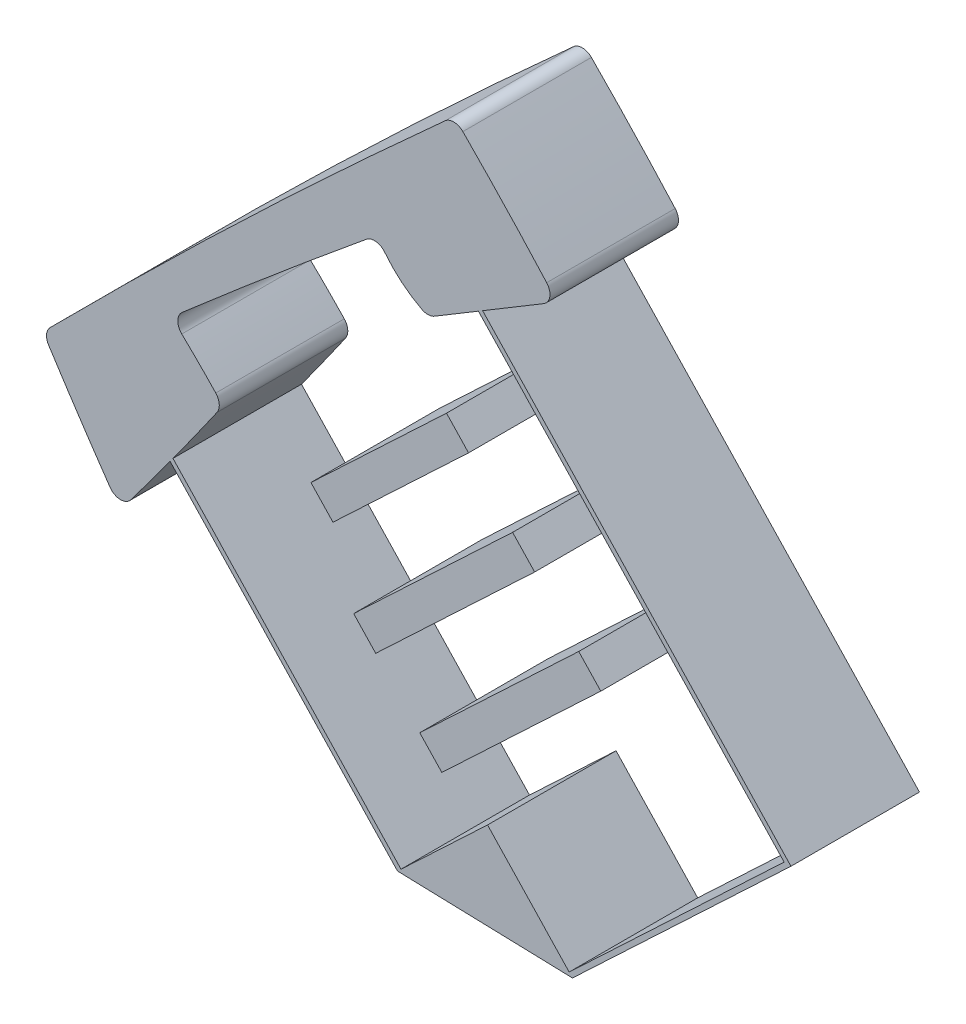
ISO-10303-21;
HEADER;
FILE_DESCRIPTION(('STEP AP214'),'2;1');
FILE_NAME('part.step','',(''),(''),'','','');
FILE_SCHEMA(('AUTOMOTIVE_DESIGN { 1 0 10303 214 1 1 1 1 }'));
ENDSEC;
DATA;
#1=APPLICATION_CONTEXT('core data for automotive mechanical design processes');
#2=APPLICATION_PROTOCOL_DEFINITION('international standard','automotive_design',2000,#1);
#3=PRODUCT_CONTEXT('',#1,'mechanical');
#4=PRODUCT('Part','Part','',(#3));
#5=PRODUCT_RELATED_PRODUCT_CATEGORY('part','',(#4));
#6=PRODUCT_DEFINITION_FORMATION('','',#4);
#7=PRODUCT_DEFINITION_CONTEXT('part definition',#1,'design');
#8=PRODUCT_DEFINITION('design','',#6,#7);
#9=PRODUCT_DEFINITION_SHAPE('','',#8);
#10=(LENGTH_UNIT() NAMED_UNIT(*) SI_UNIT(.MILLI.,.METRE.));
#11=(NAMED_UNIT(*) PLANE_ANGLE_UNIT() SI_UNIT($,.RADIAN.));
#12=(NAMED_UNIT(*) SI_UNIT($,.STERADIAN.) SOLID_ANGLE_UNIT());
#13=UNCERTAINTY_MEASURE_WITH_UNIT(LENGTH_MEASURE(1.E-05),#10,'distance_accuracy_value','');
#14=(GEOMETRIC_REPRESENTATION_CONTEXT(3) GLOBAL_UNCERTAINTY_ASSIGNED_CONTEXT((#13)) GLOBAL_UNIT_ASSIGNED_CONTEXT((#10,
#11,#12)) REPRESENTATION_CONTEXT('',''));
#15=CARTESIAN_POINT('',(0.,0.,0.));
#16=DIRECTION('',(0.,0.,1.));
#17=DIRECTION('',(1.,0.,0.));
#18=AXIS2_PLACEMENT_3D('',#15,#16,#17);
#19=CARTESIAN_POINT('',(6.62262907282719,3.47878783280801,0.));
#20=DIRECTION('',(0.686013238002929,-0.727589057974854,0.));
#21=DIRECTION('',(0.727589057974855,0.686013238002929,0.));
#22=AXIS2_PLACEMENT_3D('',#19,#20,#21);
#23=PLANE('',#22);
#24=DIRECTION('',(0.727589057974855,0.686013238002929,0.));
#25=VECTOR('',#24,1.);
#26=CARTESIAN_POINT('',(6.62262907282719,3.47878783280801,2.));
#27=LINE('',#26,#25);
#28=CARTESIAN_POINT('',(4.51262080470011,1.48934944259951,2.));
#29=VERTEX_POINT('',#28);
#30=CARTESIAN_POINT('',(6.62262907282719,3.47878783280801,2.));
#31=VERTEX_POINT('',#30);
#32=EDGE_CURVE('E108',#29,#31,#27,.T.);
#33=ORIENTED_EDGE('',*,*,#32,.F.);
#34=DIRECTION('',(0.,0.,1.));
#35=VECTOR('',#34,1.);
#36=CARTESIAN_POINT('',(4.51262080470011,1.48934944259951,0.));
#37=LINE('',#36,#35);
#38=CARTESIAN_POINT('',(4.51262080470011,1.48934944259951,0.));
#39=VERTEX_POINT('',#38);
#40=EDGE_CURVE('E12',#39,#29,#37,.T.);
#41=ORIENTED_EDGE('',*,*,#40,.F.);
#42=DIRECTION('',(0.727589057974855,0.686013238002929,0.));
#43=VECTOR('',#42,1.);
#44=CARTESIAN_POINT('',(6.62262907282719,3.47878783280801,0.));
#45=LINE('',#44,#43);
#46=CARTESIAN_POINT('',(6.62262907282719,3.47878783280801,0.));
#47=VERTEX_POINT('',#46);
#48=EDGE_CURVE('E102',#39,#47,#45,.T.);
#49=ORIENTED_EDGE('',*,*,#48,.T.);
#50=DIRECTION('',(0.,0.,1.));
#51=VECTOR('',#50,1.);
#52=CARTESIAN_POINT('',(6.62262907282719,3.47878783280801,0.));
#53=LINE('',#52,#51);
#54=EDGE_CURVE('E47',#47,#31,#53,.T.);
#55=ORIENTED_EDGE('',*,*,#54,.T.);
#56=EDGE_LOOP('',(#33,#41,#49,#55));
#57=FACE_BOUND('',#56,.T.);
#58=ADVANCED_FACE('F44',(#57),#23,.T.);
#59=CARTESIAN_POINT('',(4.16961418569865,1.85314397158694,0.));
#60=DIRECTION('',(-0.727589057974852,-0.686013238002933,0.));
#61=DIRECTION('',(0.686013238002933,-0.727589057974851,0.));
#62=AXIS2_PLACEMENT_3D('',#59,#60,#61);
#63=PLANE('',#62);
#64=DIRECTION('',(0.686013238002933,-0.727589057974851,0.));
#65=VECTOR('',#64,1.);
#66=CARTESIAN_POINT('',(4.16961418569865,1.85314397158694,2.));
#67=LINE('',#66,#65);
#68=CARTESIAN_POINT('',(4.16961418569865,1.85314397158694,2.));
#69=VERTEX_POINT('',#68);
#70=EDGE_CURVE('E104',#69,#29,#67,.T.);
#71=ORIENTED_EDGE('',*,*,#70,.F.);
#72=DIRECTION('',(0.,0.,1.));
#73=VECTOR('',#72,1.);
#74=CARTESIAN_POINT('',(4.16961418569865,1.85314397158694,0.));
#75=LINE('',#74,#73);
#76=CARTESIAN_POINT('',(4.16961418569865,1.85314397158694,0.));
#77=VERTEX_POINT('',#76);
#78=EDGE_CURVE('E53',#77,#69,#75,.T.);
#79=ORIENTED_EDGE('',*,*,#78,.F.);
#80=DIRECTION('',(0.686013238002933,-0.727589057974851,0.));
#81=VECTOR('',#80,1.);
#82=CARTESIAN_POINT('',(4.16961418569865,1.85314397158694,0.));
#83=LINE('',#82,#81);
#84=EDGE_CURVE('E99',#77,#39,#83,.T.);
#85=ORIENTED_EDGE('',*,*,#84,.T.);
#86=ORIENTED_EDGE('',*,*,#40,.T.);
#87=EDGE_LOOP('',(#71,#79,#85,#86));
#88=FACE_BOUND('',#87,.T.);
#89=ADVANCED_FACE('F118',(#88),#63,.T.);
#90=CARTESIAN_POINT('',(6.27962245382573,3.84258236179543,0.));
#91=DIRECTION('',(-0.686013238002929,0.727589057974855,0.));
#92=DIRECTION('',(-0.727589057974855,-0.686013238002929,0.));
#93=AXIS2_PLACEMENT_3D('',#90,#91,#92);
#94=PLANE('',#93);
#95=DIRECTION('',(-0.727589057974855,-0.686013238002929,0.));
#96=VECTOR('',#95,1.);
#97=CARTESIAN_POINT('',(6.27962245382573,3.84258236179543,2.));
#98=LINE('',#97,#96);
#99=CARTESIAN_POINT('',(6.27962245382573,3.84258236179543,2.));
#100=VERTEX_POINT('',#99);
#101=EDGE_CURVE('E94',#100,#69,#98,.T.);
#102=ORIENTED_EDGE('',*,*,#101,.F.);
#103=DIRECTION('',(0.,0.,1.));
#104=VECTOR('',#103,1.);
#105=CARTESIAN_POINT('',(6.27962245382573,3.84258236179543,0.));
#106=LINE('',#105,#104);
#107=CARTESIAN_POINT('',(6.27962245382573,3.84258236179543,0.));
#108=VERTEX_POINT('',#107);
#109=EDGE_CURVE('E89',#108,#100,#106,.T.);
#110=ORIENTED_EDGE('',*,*,#109,.F.);
#111=DIRECTION('',(-0.727589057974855,-0.686013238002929,0.));
#112=VECTOR('',#111,1.);
#113=CARTESIAN_POINT('',(6.27962245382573,3.84258236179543,0.));
#114=LINE('',#113,#112);
#115=EDGE_CURVE('E92',#108,#77,#114,.T.);
#116=ORIENTED_EDGE('',*,*,#115,.T.);
#117=ORIENTED_EDGE('',*,*,#78,.T.);
#118=EDGE_LOOP('',(#102,#110,#116,#117));
#119=FACE_BOUND('',#118,.T.);
#120=ADVANCED_FACE('F91',(#119),#94,.T.);
#121=CARTESIAN_POINT('',(6.27962245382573,3.84258236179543,0.));
#122=DIRECTION('',(0.727589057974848,0.686013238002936,0.));
#123=DIRECTION('',(-0.686013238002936,0.727589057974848,0.));
#124=AXIS2_PLACEMENT_3D('',#121,#122,#123);
#125=PLANE('',#124);
#126=DIRECTION('',(-0.686013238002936,0.727589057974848,0.));
#127=VECTOR('',#126,1.);
#128=CARTESIAN_POINT('',(6.27962245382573,3.84258236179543,2.));
#129=LINE('',#128,#127);
#130=EDGE_CURVE('E111',#31,#100,#129,.T.);
#131=ORIENTED_EDGE('',*,*,#130,.F.);
#132=ORIENTED_EDGE('',*,*,#54,.F.);
#133=DIRECTION('',(-0.686013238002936,0.727589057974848,0.));
#134=VECTOR('',#133,1.);
#135=CARTESIAN_POINT('',(6.27962245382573,3.84258236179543,0.));
#136=LINE('',#135,#134);
#137=EDGE_CURVE('E98',#47,#108,#136,.T.);
#138=ORIENTED_EDGE('',*,*,#137,.T.);
#139=ORIENTED_EDGE('',*,*,#109,.T.);
#140=EDGE_LOOP('',(#131,#132,#138,#139));
#141=FACE_BOUND('',#140,.T.);
#142=ADVANCED_FACE('F101',(#141),#125,.T.);
#143=CARTESIAN_POINT('',(4.51262080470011,1.48934944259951,0.));
#144=DIRECTION('',(0.,0.,1.));
#145=DIRECTION('',(1.,0.,0.));
#146=AXIS2_PLACEMENT_3D('',#143,#144,#145);
#147=PLANE('',#146);
#148=ORIENTED_EDGE('',*,*,#48,.F.);
#149=ORIENTED_EDGE('',*,*,#84,.F.);
#150=ORIENTED_EDGE('',*,*,#115,.F.);
#151=ORIENTED_EDGE('',*,*,#137,.F.);
#152=EDGE_LOOP('',(#148,#149,#150,#151));
#153=FACE_BOUND('',#152,.T.);
#154=ADVANCED_FACE('F97',(#153),#147,.F.);
#155=CARTESIAN_POINT('',(4.51262080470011,1.48934944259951,2.));
#156=DIRECTION('',(0.,0.,1.));
#157=DIRECTION('',(1.,0.,0.));
#158=AXIS2_PLACEMENT_3D('',#155,#156,#157);
#159=PLANE('',#158);
#160=ORIENTED_EDGE('',*,*,#32,.T.);
#161=ORIENTED_EDGE('',*,*,#130,.T.);
#162=ORIENTED_EDGE('',*,*,#101,.T.);
#163=ORIENTED_EDGE('',*,*,#70,.T.);
#164=EDGE_LOOP('',(#160,#161,#162,#163));
#165=FACE_BOUND('',#164,.T.);
#166=ADVANCED_FACE('F117',(#165),#159,.T.);
#167=CLOSED_SHELL('',(#58,#89,#120,#142,#154,#166));
#168=MANIFOLD_SOLID_BREP('B2',#167);
#169=CARTESIAN_POINT('',(7.30864231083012,2.75119877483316,0.));
#170=DIRECTION('',(0.727589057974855,0.686013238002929,0.));
#171=DIRECTION('',(-0.686013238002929,0.727589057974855,0.));
#172=AXIS2_PLACEMENT_3D('',#169,#170,#171);
#173=PLANE('',#172);
#174=DIRECTION('',(-0.686013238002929,0.727589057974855,0.));
#175=VECTOR('',#174,1.);
#176=CARTESIAN_POINT('',(7.30864231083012,2.75119877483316,2.));
#177=LINE('',#176,#175);
#178=CARTESIAN_POINT('',(7.65164892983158,2.38740424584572,2.));
#179=VERTEX_POINT('',#178);
#180=CARTESIAN_POINT('',(7.30864231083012,2.75119877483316,2.));
#181=VERTEX_POINT('',#180);
#182=EDGE_CURVE('E242',#179,#181,#177,.T.);
#183=ORIENTED_EDGE('',*,*,#182,.F.);
#184=DIRECTION('',(0.,0.,1.));
#185=VECTOR('',#184,1.);
#186=CARTESIAN_POINT('',(7.65164892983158,2.38740424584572,0.));
#187=LINE('',#186,#185);
#188=CARTESIAN_POINT('',(7.65164892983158,2.38740424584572,0.));
#189=VERTEX_POINT('',#188);
#190=EDGE_CURVE('E42',#189,#179,#187,.T.);
#191=ORIENTED_EDGE('',*,*,#190,.F.);
#192=DIRECTION('',(-0.686013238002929,0.727589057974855,0.));
#193=VECTOR('',#192,1.);
#194=CARTESIAN_POINT('',(7.30864231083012,2.75119877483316,0.));
#195=LINE('',#194,#193);
#196=CARTESIAN_POINT('',(7.30864231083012,2.75119877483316,0.));
#197=VERTEX_POINT('',#196);
#198=EDGE_CURVE('E236',#189,#197,#195,.T.);
#199=ORIENTED_EDGE('',*,*,#198,.T.);
#200=DIRECTION('',(0.,0.,1.));
#201=VECTOR('',#200,1.);
#202=CARTESIAN_POINT('',(7.30864231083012,2.75119877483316,0.));
#203=LINE('',#202,#201);
#204=EDGE_CURVE('E181',#197,#181,#203,.T.);
#205=ORIENTED_EDGE('',*,*,#204,.T.);
#206=EDGE_LOOP('',(#183,#191,#199,#205));
#207=FACE_BOUND('',#206,.T.);
#208=ADVANCED_FACE('F178',(#207),#173,.T.);
#209=CARTESIAN_POINT('',(7.65164892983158,2.38740424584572,0.));
#210=DIRECTION('',(0.686013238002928,-0.727589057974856,0.));
#211=DIRECTION('',(0.727589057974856,0.686013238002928,0.));
#212=AXIS2_PLACEMENT_3D('',#209,#210,#211);
#213=PLANE('',#212);
#214=DIRECTION('',(0.727589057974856,0.686013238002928,0.));
#215=VECTOR('',#214,1.);
#216=CARTESIAN_POINT('',(7.65164892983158,2.38740424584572,2.));
#217=LINE('',#216,#215);
#218=CARTESIAN_POINT('',(5.17784613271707,0.0549592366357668,2.));
#219=VERTEX_POINT('',#218);
#220=EDGE_CURVE('E238',#219,#179,#217,.T.);
#221=ORIENTED_EDGE('',*,*,#220,.F.);
#222=DIRECTION('',(0.,0.,1.));
#223=VECTOR('',#222,1.);
#224=CARTESIAN_POINT('',(5.17784613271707,0.0549592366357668,0.));
#225=LINE('',#224,#223);
#226=CARTESIAN_POINT('',(5.17784613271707,0.0549592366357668,0.));
#227=VERTEX_POINT('',#226);
#228=EDGE_CURVE('E187',#227,#219,#225,.T.);
#229=ORIENTED_EDGE('',*,*,#228,.F.);
#230=DIRECTION('',(0.727589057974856,0.686013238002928,0.));
#231=VECTOR('',#230,1.);
#232=CARTESIAN_POINT('',(7.65164892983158,2.38740424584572,0.));
#233=LINE('',#232,#231);
#234=EDGE_CURVE('E233',#227,#189,#233,.T.);
#235=ORIENTED_EDGE('',*,*,#234,.T.);
#236=ORIENTED_EDGE('',*,*,#190,.T.);
#237=EDGE_LOOP('',(#221,#229,#235,#236));
#238=FACE_BOUND('',#237,.T.);
#239=ADVANCED_FACE('F252',(#238),#213,.T.);
#240=CARTESIAN_POINT('',(4.83483951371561,0.418753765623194,0.));
#241=DIRECTION('',(-0.727589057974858,-0.686013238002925,0.));
#242=DIRECTION('',(0.686013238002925,-0.727589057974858,0.));
#243=AXIS2_PLACEMENT_3D('',#240,#241,#242);
#244=PLANE('',#243);
#245=DIRECTION('',(0.686013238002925,-0.727589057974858,0.));
#246=VECTOR('',#245,1.);
#247=CARTESIAN_POINT('',(4.83483951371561,0.418753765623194,2.));
#248=LINE('',#247,#246);
#249=CARTESIAN_POINT('',(4.83483951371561,0.418753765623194,2.));
#250=VERTEX_POINT('',#249);
#251=EDGE_CURVE('E228',#250,#219,#248,.T.);
#252=ORIENTED_EDGE('',*,*,#251,.F.);
#253=DIRECTION('',(0.,0.,1.));
#254=VECTOR('',#253,1.);
#255=CARTESIAN_POINT('',(4.83483951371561,0.418753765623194,0.));
#256=LINE('',#255,#254);
#257=CARTESIAN_POINT('',(4.83483951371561,0.418753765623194,0.));
#258=VERTEX_POINT('',#257);
#259=EDGE_CURVE('E223',#258,#250,#256,.T.);
#260=ORIENTED_EDGE('',*,*,#259,.F.);
#261=DIRECTION('',(0.686013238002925,-0.727589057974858,0.));
#262=VECTOR('',#261,1.);
#263=CARTESIAN_POINT('',(4.83483951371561,0.418753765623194,0.));
#264=LINE('',#263,#262);
#265=EDGE_CURVE('E226',#258,#227,#264,.T.);
#266=ORIENTED_EDGE('',*,*,#265,.T.);
#267=ORIENTED_EDGE('',*,*,#228,.T.);
#268=EDGE_LOOP('',(#252,#260,#266,#267));
#269=FACE_BOUND('',#268,.T.);
#270=ADVANCED_FACE('F225',(#269),#244,.T.);
#271=CARTESIAN_POINT('',(7.30864231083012,2.75119877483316,0.));
#272=DIRECTION('',(-0.68601323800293,0.727589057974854,0.));
#273=DIRECTION('',(-0.727589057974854,-0.68601323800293,0.));
#274=AXIS2_PLACEMENT_3D('',#271,#272,#273);
#275=PLANE('',#274);
#276=DIRECTION('',(-0.727589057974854,-0.68601323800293,0.));
#277=VECTOR('',#276,1.);
#278=CARTESIAN_POINT('',(7.30864231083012,2.75119877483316,2.));
#279=LINE('',#278,#277);
#280=EDGE_CURVE('E245',#181,#250,#279,.T.);
#281=ORIENTED_EDGE('',*,*,#280,.F.);
#282=ORIENTED_EDGE('',*,*,#204,.F.);
#283=DIRECTION('',(-0.727589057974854,-0.68601323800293,0.));
#284=VECTOR('',#283,1.);
#285=CARTESIAN_POINT('',(7.30864231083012,2.75119877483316,0.));
#286=LINE('',#285,#284);
#287=EDGE_CURVE('E232',#197,#258,#286,.T.);
#288=ORIENTED_EDGE('',*,*,#287,.T.);
#289=ORIENTED_EDGE('',*,*,#259,.T.);
#290=EDGE_LOOP('',(#281,#282,#288,#289));
#291=FACE_BOUND('',#290,.T.);
#292=ADVANCED_FACE('F235',(#291),#275,.T.);
#293=CARTESIAN_POINT('',(7.65164892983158,2.38740424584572,0.));
#294=DIRECTION('',(0.,0.,-1.));
#295=DIRECTION('',(-1.,0.,0.));
#296=AXIS2_PLACEMENT_3D('',#293,#294,#295);
#297=PLANE('',#296);
#298=ORIENTED_EDGE('',*,*,#198,.F.);
#299=ORIENTED_EDGE('',*,*,#234,.F.);
#300=ORIENTED_EDGE('',*,*,#265,.F.);
#301=ORIENTED_EDGE('',*,*,#287,.F.);
#302=EDGE_LOOP('',(#298,#299,#300,#301));
#303=FACE_BOUND('',#302,.T.);
#304=ADVANCED_FACE('F231',(#303),#297,.T.);
#305=CARTESIAN_POINT('',(7.65164892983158,2.38740424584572,2.));
#306=DIRECTION('',(0.,0.,-1.));
#307=DIRECTION('',(-1.,0.,0.));
#308=AXIS2_PLACEMENT_3D('',#305,#306,#307);
#309=PLANE('',#308);
#310=ORIENTED_EDGE('',*,*,#182,.T.);
#311=ORIENTED_EDGE('',*,*,#280,.T.);
#312=ORIENTED_EDGE('',*,*,#251,.T.);
#313=ORIENTED_EDGE('',*,*,#220,.T.);
#314=EDGE_LOOP('',(#310,#311,#312,#313));
#315=FACE_BOUND('',#314,.T.);
#316=ADVANCED_FACE('F251',(#315),#309,.F.);
#317=CLOSED_SHELL('',(#208,#239,#270,#292,#304,#316));
#318=MANIFOLD_SOLID_BREP('B6',#317);
#319=CARTESIAN_POINT('',(8.33766216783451,1.65981518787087,0.));
#320=DIRECTION('',(0.727589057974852,0.686013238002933,0.));
#321=DIRECTION('',(-0.686013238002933,0.727589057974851,0.));
#322=AXIS2_PLACEMENT_3D('',#319,#320,#321);
#323=PLANE('',#322);
#324=DIRECTION('',(-0.686013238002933,0.727589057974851,0.));
#325=VECTOR('',#324,1.);
#326=CARTESIAN_POINT('',(8.33766216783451,1.65981518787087,2.));
#327=LINE('',#326,#325);
#328=CARTESIAN_POINT('',(8.68066878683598,1.29602065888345,2.));
#329=VERTEX_POINT('',#328);
#330=CARTESIAN_POINT('',(8.33766216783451,1.65981518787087,2.));
#331=VERTEX_POINT('',#330);
#332=EDGE_CURVE('E375',#329,#331,#327,.T.);
#333=ORIENTED_EDGE('',*,*,#332,.F.);
#334=DIRECTION('',(0.,0.,1.));
#335=VECTOR('',#334,1.);
#336=CARTESIAN_POINT('',(8.68066878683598,1.29602065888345,0.));
#337=LINE('',#336,#335);
#338=CARTESIAN_POINT('',(8.68066878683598,1.29602065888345,0.));
#339=VERTEX_POINT('',#338);
#340=EDGE_CURVE('E176',#339,#329,#337,.T.);
#341=ORIENTED_EDGE('',*,*,#340,.F.);
#342=DIRECTION('',(-0.686013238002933,0.727589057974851,0.));
#343=VECTOR('',#342,1.);
#344=CARTESIAN_POINT('',(8.33766216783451,1.65981518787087,0.));
#345=LINE('',#344,#343);
#346=CARTESIAN_POINT('',(8.33766216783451,1.65981518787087,0.));
#347=VERTEX_POINT('',#346);
#348=EDGE_CURVE('E369',#339,#347,#345,.T.);
#349=ORIENTED_EDGE('',*,*,#348,.T.);
#350=DIRECTION('',(0.,0.,1.));
#351=VECTOR('',#350,1.);
#352=CARTESIAN_POINT('',(8.33766216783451,1.65981518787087,0.));
#353=LINE('',#352,#351);
#354=EDGE_CURVE('E314',#347,#331,#353,.T.);
#355=ORIENTED_EDGE('',*,*,#354,.T.);
#356=EDGE_LOOP('',(#333,#341,#349,#355));
#357=FACE_BOUND('',#356,.T.);
#358=ADVANCED_FACE('F311',(#357),#323,.T.);
#359=CARTESIAN_POINT('',(8.68066878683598,1.29602065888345,0.));
#360=DIRECTION('',(0.686013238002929,-0.727589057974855,0.));
#361=DIRECTION('',(0.727589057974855,0.686013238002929,0.));
#362=AXIS2_PLACEMENT_3D('',#359,#360,#361);
#363=PLANE('',#362);
#364=DIRECTION('',(0.727589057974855,0.686013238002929,0.));
#365=VECTOR('',#364,1.);
#366=CARTESIAN_POINT('',(8.68066878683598,1.29602065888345,2.));
#367=LINE('',#366,#365);
#368=CARTESIAN_POINT('',(6.20686598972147,-1.03642435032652,2.));
#369=VERTEX_POINT('',#368);
#370=EDGE_CURVE('E371',#369,#329,#367,.T.);
#371=ORIENTED_EDGE('',*,*,#370,.F.);
#372=DIRECTION('',(0.,0.,1.));
#373=VECTOR('',#372,1.);
#374=CARTESIAN_POINT('',(6.20686598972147,-1.03642435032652,0.));
#375=LINE('',#374,#373);
#376=CARTESIAN_POINT('',(6.20686598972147,-1.03642435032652,0.));
#377=VERTEX_POINT('',#376);
#378=EDGE_CURVE('E320',#377,#369,#375,.T.);
#379=ORIENTED_EDGE('',*,*,#378,.F.);
#380=DIRECTION('',(0.727589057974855,0.686013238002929,0.));
#381=VECTOR('',#380,1.);
#382=CARTESIAN_POINT('',(8.68066878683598,1.29602065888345,0.));
#383=LINE('',#382,#381);
#384=EDGE_CURVE('E366',#377,#339,#383,.T.);
#385=ORIENTED_EDGE('',*,*,#384,.T.);
#386=ORIENTED_EDGE('',*,*,#340,.T.);
#387=EDGE_LOOP('',(#371,#379,#385,#386));
#388=FACE_BOUND('',#387,.T.);
#389=ADVANCED_FACE('F385',(#388),#363,.T.);
#390=CARTESIAN_POINT('',(5.86385937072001,-0.672629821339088,0.));
#391=DIRECTION('',(-0.727589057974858,-0.686013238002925,0.));
#392=DIRECTION('',(0.686013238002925,-0.727589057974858,0.));
#393=AXIS2_PLACEMENT_3D('',#390,#391,#392);
#394=PLANE('',#393);
#395=DIRECTION('',(0.686013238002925,-0.727589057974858,0.));
#396=VECTOR('',#395,1.);
#397=CARTESIAN_POINT('',(5.86385937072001,-0.672629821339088,2.));
#398=LINE('',#397,#396);
#399=CARTESIAN_POINT('',(5.86385937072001,-0.672629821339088,2.));
#400=VERTEX_POINT('',#399);
#401=EDGE_CURVE('E361',#400,#369,#398,.T.);
#402=ORIENTED_EDGE('',*,*,#401,.F.);
#403=DIRECTION('',(0.,0.,1.));
#404=VECTOR('',#403,1.);
#405=CARTESIAN_POINT('',(5.86385937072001,-0.672629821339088,0.));
#406=LINE('',#405,#404);
#407=CARTESIAN_POINT('',(5.86385937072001,-0.672629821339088,0.));
#408=VERTEX_POINT('',#407);
#409=EDGE_CURVE('E356',#408,#400,#406,.T.);
#410=ORIENTED_EDGE('',*,*,#409,.F.);
#411=DIRECTION('',(0.686013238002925,-0.727589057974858,0.));
#412=VECTOR('',#411,1.);
#413=CARTESIAN_POINT('',(5.86385937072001,-0.672629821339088,0.));
#414=LINE('',#413,#412);
#415=EDGE_CURVE('E359',#408,#377,#414,.T.);
#416=ORIENTED_EDGE('',*,*,#415,.T.);
#417=ORIENTED_EDGE('',*,*,#378,.T.);
#418=EDGE_LOOP('',(#402,#410,#416,#417));
#419=FACE_BOUND('',#418,.T.);
#420=ADVANCED_FACE('F358',(#419),#394,.T.);
#421=CARTESIAN_POINT('',(8.33766216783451,1.65981518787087,0.));
#422=DIRECTION('',(-0.68601323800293,0.727589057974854,0.));
#423=DIRECTION('',(-0.727589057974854,-0.68601323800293,0.));
#424=AXIS2_PLACEMENT_3D('',#421,#422,#423);
#425=PLANE('',#424);
#426=DIRECTION('',(-0.727589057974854,-0.68601323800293,0.));
#427=VECTOR('',#426,1.);
#428=CARTESIAN_POINT('',(8.33766216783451,1.65981518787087,2.));
#429=LINE('',#428,#427);
#430=EDGE_CURVE('E378',#331,#400,#429,.T.);
#431=ORIENTED_EDGE('',*,*,#430,.F.);
#432=ORIENTED_EDGE('',*,*,#354,.F.);
#433=DIRECTION('',(-0.727589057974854,-0.68601323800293,0.));
#434=VECTOR('',#433,1.);
#435=CARTESIAN_POINT('',(8.33766216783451,1.65981518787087,0.));
#436=LINE('',#435,#434);
#437=EDGE_CURVE('E365',#347,#408,#436,.T.);
#438=ORIENTED_EDGE('',*,*,#437,.T.);
#439=ORIENTED_EDGE('',*,*,#409,.T.);
#440=EDGE_LOOP('',(#431,#432,#438,#439));
#441=FACE_BOUND('',#440,.T.);
#442=ADVANCED_FACE('F368',(#441),#425,.T.);
#443=CARTESIAN_POINT('',(8.68066878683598,1.29602065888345,0.));
#444=DIRECTION('',(0.,0.,-1.));
#445=DIRECTION('',(-1.,0.,0.));
#446=AXIS2_PLACEMENT_3D('',#443,#444,#445);
#447=PLANE('',#446);
#448=ORIENTED_EDGE('',*,*,#348,.F.);
#449=ORIENTED_EDGE('',*,*,#384,.F.);
#450=ORIENTED_EDGE('',*,*,#415,.F.);
#451=ORIENTED_EDGE('',*,*,#437,.F.);
#452=EDGE_LOOP('',(#448,#449,#450,#451));
#453=FACE_BOUND('',#452,.T.);
#454=ADVANCED_FACE('F364',(#453),#447,.T.);
#455=CARTESIAN_POINT('',(8.68066878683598,1.29602065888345,2.));
#456=DIRECTION('',(0.,0.,-1.));
#457=DIRECTION('',(-1.,0.,0.));
#458=AXIS2_PLACEMENT_3D('',#455,#456,#457);
#459=PLANE('',#458);
#460=ORIENTED_EDGE('',*,*,#332,.T.);
#461=ORIENTED_EDGE('',*,*,#430,.T.);
#462=ORIENTED_EDGE('',*,*,#401,.T.);
#463=ORIENTED_EDGE('',*,*,#370,.T.);
#464=EDGE_LOOP('',(#460,#461,#462,#463));
#465=FACE_BOUND('',#464,.T.);
#466=ADVANCED_FACE('F384',(#465),#459,.F.);
#467=CLOSED_SHELL('',(#358,#389,#420,#442,#454,#466));
#468=MANIFOLD_SOLID_BREP('B36',#467);
#469=CARTESIAN_POINT('',(6.,5.,2.));
#470=DIRECTION('',(-0.514495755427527,0.857492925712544,0.));
#471=DIRECTION('',(-0.857492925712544,-0.514495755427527,0.));
#472=AXIS2_PLACEMENT_3D('',#469,#470,#471);
#473=PLANE('',#472);
#474=DIRECTION('',(0.857492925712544,0.514495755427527,0.));
#475=VECTOR('',#474,1.);
#476=CARTESIAN_POINT('',(6.,5.,2.));
#477=LINE('',#476,#475);
#478=CARTESIAN_POINT('',(6.0923126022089,5.05538756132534,2.));
#479=VERTEX_POINT('',#478);
#480=CARTESIAN_POINT('',(6.77637705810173,5.46582623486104,2.));
#481=VERTEX_POINT('',#480);
#482=EDGE_CURVE('E714',#479,#481,#477,.T.);
#483=ORIENTED_EDGE('',*,*,#482,.F.);
#484=DIRECTION('',(0.,0.,-1.));
#485=VECTOR('',#484,1.);
#486=CARTESIAN_POINT('',(6.0923126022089,5.05538756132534,2.));
#487=LINE('',#486,#485);
#488=CARTESIAN_POINT('',(6.0923126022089,5.05538756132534,0.));
#489=VERTEX_POINT('',#488);
#490=EDGE_CURVE('E785',#479,#489,#487,.T.);
#491=ORIENTED_EDGE('',*,*,#490,.T.);
#492=DIRECTION('',(0.857492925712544,0.514495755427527,0.));
#493=VECTOR('',#492,1.);
#494=CARTESIAN_POINT('',(6.,5.,0.));
#495=LINE('',#494,#493);
#496=CARTESIAN_POINT('',(6.77637705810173,5.46582623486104,0.));
#497=VERTEX_POINT('',#496);
#498=EDGE_CURVE('E737',#489,#497,#495,.T.);
#499=ORIENTED_EDGE('',*,*,#498,.T.);
#500=DIRECTION('',(0.,0.,1.));
#501=VECTOR('',#500,1.);
#502=CARTESIAN_POINT('',(6.77637705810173,5.46582623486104,2.));
#503=LINE('',#502,#501);
#504=EDGE_CURVE('E697',#497,#481,#503,.T.);
#505=ORIENTED_EDGE('',*,*,#504,.T.);
#506=EDGE_LOOP('',(#483,#491,#499,#505));
#507=FACE_BOUND('',#506,.T.);
#508=ADVANCED_FACE('F435',(#507),#473,.F.);
#509=CARTESIAN_POINT('',(-45.9519434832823,35.9741407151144,2.));
#510=DIRECTION('',(0.,0.,-1.));
#511=DIRECTION('',(-1.,0.,0.));
#512=AXIS2_PLACEMENT_3D('',#509,#510,#511);
#513=CYLINDRICAL_SURFACE('',#512,59.3080481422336);
#514=CARTESIAN_POINT('',(-45.9519434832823,35.9741407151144,2.));
#515=DIRECTION('',(0.,0.,1.));
#516=DIRECTION('',(-1.,0.,0.));
#517=AXIS2_PLACEMENT_3D('',#514,#515,#516);
#518=CIRCLE('',#517,59.3080481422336);
#519=CARTESIAN_POINT('',(1.36675041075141,0.219619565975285,2.));
#520=VERTEX_POINT('',#519);
#521=CARTESIAN_POINT('',(1.97786049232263,1.04308769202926,2.));
#522=VERTEX_POINT('',#521);
#523=EDGE_CURVE('E726',#520,#522,#518,.T.);
#524=ORIENTED_EDGE('',*,*,#523,.F.);
#525=DIRECTION('',(0.,0.,-1.));
#526=VECTOR('',#525,1.);
#527=CARTESIAN_POINT('',(1.36675041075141,0.219619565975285,2.));
#528=LINE('',#527,#526);
#529=CARTESIAN_POINT('',(1.36675041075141,0.219619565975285,0.));
#530=VERTEX_POINT('',#529);
#531=EDGE_CURVE('E809',#520,#530,#528,.T.);
#532=ORIENTED_EDGE('',*,*,#531,.T.);
#533=CARTESIAN_POINT('',(-45.9519434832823,35.9741407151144,0.));
#534=DIRECTION('',(0.,0.,1.));
#535=DIRECTION('',(-1.,0.,0.));
#536=AXIS2_PLACEMENT_3D('',#533,#534,#535);
#537=CIRCLE('',#536,59.3080481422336);
#538=CARTESIAN_POINT('',(1.97786049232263,1.04308769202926,0.));
#539=VERTEX_POINT('',#538);
#540=EDGE_CURVE('E709',#530,#539,#537,.T.);
#541=ORIENTED_EDGE('',*,*,#540,.T.);
#542=DIRECTION('',(0.,0.,-1.));
#543=VECTOR('',#542,1.);
#544=CARTESIAN_POINT('',(1.97786049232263,1.04308769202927,2.));
#545=LINE('',#544,#543);
#546=EDGE_CURVE('E623',#539,#522,#545,.F.);
#547=ORIENTED_EDGE('',*,*,#546,.T.);
#548=EDGE_LOOP('',(#524,#532,#541,#547));
#549=FACE_BOUND('',#548,.T.);
#550=ADVANCED_FACE('F878',(#549),#513,.T.);
#551=CARTESIAN_POINT('',(-8.53649714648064,-8.33649714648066,2.));
#552=DIRECTION('',(0.,0.,-1.));
#553=DIRECTION('',(-1.,0.,0.));
#554=AXIS2_PLACEMENT_3D('',#551,#552,#553);
#555=CYLINDRICAL_SURFACE('',#554,15.4768840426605);
#556=CARTESIAN_POINT('',(-8.53649714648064,-8.33649714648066,0.));
#557=DIRECTION('',(0.,0.,1.));
#558=DIRECTION('',(1.,0.,0.));
#559=AXIS2_PLACEMENT_3D('',#556,#557,#558);
#560=CIRCLE('',#559,15.4768840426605);
#561=CARTESIAN_POINT('',(2.68839956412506,2.31881296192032,0.));
#562=VERTEX_POINT('',#561);
#563=CARTESIAN_POINT('',(2.15966447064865,2.84947917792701,0.));
#564=VERTEX_POINT('',#563);
#565=EDGE_CURVE('E704',#562,#564,#560,.T.);
#566=ORIENTED_EDGE('',*,*,#565,.T.);
#567=DIRECTION('',(0.,0.,-1.));
#568=VECTOR('',#567,1.);
#569=CARTESIAN_POINT('',(2.15966447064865,2.84947917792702,2.));
#570=LINE('',#569,#568);
#571=CARTESIAN_POINT('',(2.15966447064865,2.84947917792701,2.));
#572=VERTEX_POINT('',#571);
#573=EDGE_CURVE('E800',#564,#572,#570,.F.);
#574=ORIENTED_EDGE('',*,*,#573,.T.);
#575=CARTESIAN_POINT('',(-8.53649714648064,-8.33649714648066,2.));
#576=DIRECTION('',(0.,0.,1.));
#577=DIRECTION('',(1.,0.,0.));
#578=AXIS2_PLACEMENT_3D('',#575,#576,#577);
#579=CIRCLE('',#578,15.4768840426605);
#580=CARTESIAN_POINT('',(2.68839956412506,2.31881296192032,2.));
#581=VERTEX_POINT('',#580);
#582=EDGE_CURVE('E705',#581,#572,#579,.T.);
#583=ORIENTED_EDGE('',*,*,#582,.F.);
#584=DIRECTION('',(0.,0.,-1.));
#585=VECTOR('',#584,1.);
#586=CARTESIAN_POINT('',(2.68839956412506,2.31881296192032,2.));
#587=LINE('',#586,#585);
#588=EDGE_CURVE('E797',#581,#562,#587,.T.);
#589=ORIENTED_EDGE('',*,*,#588,.T.);
#590=EDGE_LOOP('',(#566,#574,#583,#589));
#591=FACE_BOUND('',#590,.T.);
#592=ADVANCED_FACE('F821',(#591),#555,.T.);
#593=CARTESIAN_POINT('',(88.7337956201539,-96.5493133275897,2.));
#594=DIRECTION('',(0.,0.,-1.));
#595=DIRECTION('',(-1.,0.,0.));
#596=AXIS2_PLACEMENT_3D('',#593,#594,#595);
#597=CYLINDRICAL_SURFACE('',#596,132.033393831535);
#598=CARTESIAN_POINT('',(88.7337956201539,-96.5493133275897,0.));
#599=DIRECTION('',(0.,0.,-1.));
#600=DIRECTION('',(-1.,0.,0.));
#601=AXIS2_PLACEMENT_3D('',#598,#599,#600);
#602=CIRCLE('',#601,132.033393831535);
#603=CARTESIAN_POINT('',(2.16675658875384,3.14504378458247,0.));
#604=VERTEX_POINT('',#603);
#605=CARTESIAN_POINT('',(5.03259637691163,5.56300880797,0.));
#606=VERTEX_POINT('',#605);
#607=EDGE_CURVE('E731',#604,#606,#602,.T.);
#608=ORIENTED_EDGE('',*,*,#607,.T.);
#609=DIRECTION('',(0.,0.,-1.));
#610=VECTOR('',#609,1.);
#611=CARTESIAN_POINT('',(5.03259637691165,5.56300880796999,2.));
#612=LINE('',#611,#610);
#613=CARTESIAN_POINT('',(5.03259637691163,5.56300880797,2.));
#614=VERTEX_POINT('',#613);
#615=EDGE_CURVE('E795',#606,#614,#612,.F.);
#616=ORIENTED_EDGE('',*,*,#615,.T.);
#617=CARTESIAN_POINT('',(88.7337956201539,-96.5493133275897,2.));
#618=DIRECTION('',(0.,0.,-1.));
#619=DIRECTION('',(-1.,0.,0.));
#620=AXIS2_PLACEMENT_3D('',#617,#618,#619);
#621=CIRCLE('',#620,132.033393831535);
#622=CARTESIAN_POINT('',(2.16675658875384,3.14504378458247,2.));
#623=VERTEX_POINT('',#622);
#624=EDGE_CURVE('E708',#623,#614,#621,.T.);
#625=ORIENTED_EDGE('',*,*,#624,.F.);
#626=DIRECTION('',(0.,0.,-1.));
#627=VECTOR('',#626,1.);
#628=CARTESIAN_POINT('',(2.16675658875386,3.14504378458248,2.));
#629=LINE('',#628,#627);
#630=EDGE_CURVE('E792',#623,#604,#629,.T.);
#631=ORIENTED_EDGE('',*,*,#630,.T.);
#632=EDGE_LOOP('',(#608,#616,#625,#631));
#633=FACE_BOUND('',#632,.T.);
#634=ADVANCED_FACE('F829',(#633),#597,.F.);
#635=CARTESIAN_POINT('',(6.72048497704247,6.6305542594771,2.));
#636=DIRECTION('',(0.,0.,-1.));
#637=DIRECTION('',(-1.,0.,0.));
#638=AXIS2_PLACEMENT_3D('',#635,#636,#637);
#639=CYLINDRICAL_SURFACE('',#638,1.78264011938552);
#640=CARTESIAN_POINT('',(6.72048497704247,6.6305542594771,0.));
#641=DIRECTION('',(0.,0.,1.));
#642=DIRECTION('',(-1.,0.,0.));
#643=AXIS2_PLACEMENT_3D('',#640,#641,#642);
#644=CIRCLE('',#643,1.78264011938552);
#645=CARTESIAN_POINT('',(5.31686125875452,5.53162466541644,0.));
#646=VERTEX_POINT('',#645);
#647=CARTESIAN_POINT('',(5.89702712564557,5.04950303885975,0.));
#648=VERTEX_POINT('',#647);
#649=EDGE_CURVE('E734',#646,#648,#644,.T.);
#650=ORIENTED_EDGE('',*,*,#649,.T.);
#651=DIRECTION('',(0.,0.,-1.));
#652=VECTOR('',#651,1.);
#653=CARTESIAN_POINT('',(5.89702712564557,5.04950303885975,2.));
#654=LINE('',#653,#652);
#655=CARTESIAN_POINT('',(5.89702712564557,5.04950303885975,2.));
#656=VERTEX_POINT('',#655);
#657=EDGE_CURVE('E450',#648,#656,#654,.F.);
#658=ORIENTED_EDGE('',*,*,#657,.T.);
#659=CARTESIAN_POINT('',(6.72048497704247,6.6305542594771,2.));
#660=DIRECTION('',(0.,0.,1.));
#661=DIRECTION('',(-1.,0.,0.));
#662=AXIS2_PLACEMENT_3D('',#659,#660,#661);
#663=CIRCLE('',#662,1.78264011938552);
#664=CARTESIAN_POINT('',(5.31686125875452,5.53162466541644,2.));
#665=VERTEX_POINT('',#664);
#666=EDGE_CURVE('E711',#665,#656,#663,.T.);
#667=ORIENTED_EDGE('',*,*,#666,.F.);
#668=DIRECTION('',(0.,0.,-1.));
#669=VECTOR('',#668,1.);
#670=CARTESIAN_POINT('',(5.31686125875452,5.53162466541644,2.));
#671=LINE('',#670,#669);
#672=EDGE_CURVE('E788',#665,#646,#671,.T.);
#673=ORIENTED_EDGE('',*,*,#672,.T.);
#674=EDGE_LOOP('',(#650,#658,#667,#673));
#675=FACE_BOUND('',#674,.T.);
#676=ADVANCED_FACE('F835',(#675),#639,.T.);
#677=CARTESIAN_POINT('',(6.84221290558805,5.50532774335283,0.));
#678=VERTEX_POINT('',#677);
#679=CARTESIAN_POINT('',(7.79283948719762,6.07570369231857,0.));
#680=VERTEX_POINT('',#679);
#681=EDGE_CURVE('E736',#678,#680,#495,.T.);
#682=ORIENTED_EDGE('',*,*,#681,.T.);
#683=DIRECTION('',(0.,0.,-1.));
#684=VECTOR('',#683,1.);
#685=CARTESIAN_POINT('',(7.79283948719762,6.07570369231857,2.));
#686=LINE('',#685,#684);
#687=CARTESIAN_POINT('',(7.79283948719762,6.07570369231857,2.));
#688=VERTEX_POINT('',#687);
#689=EDGE_CURVE('E783',#680,#688,#686,.F.);
#690=ORIENTED_EDGE('',*,*,#689,.T.);
#691=CARTESIAN_POINT('',(6.84221290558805,5.50532774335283,2.));
#692=VERTEX_POINT('',#691);
#693=EDGE_CURVE('E713',#692,#688,#477,.T.);
#694=ORIENTED_EDGE('',*,*,#693,.F.);
#695=DIRECTION('',(0.,0.,-1.));
#696=VECTOR('',#695,1.);
#697=CARTESIAN_POINT('',(6.84221290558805,5.50532774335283,2.));
#698=LINE('',#697,#696);
#699=EDGE_CURVE('E684',#692,#678,#698,.T.);
#700=ORIENTED_EDGE('',*,*,#699,.T.);
#701=EDGE_LOOP('',(#682,#690,#694,#700));
#702=FACE_BOUND('',#701,.T.);
#703=ADVANCED_FACE('F893',(#702),#473,.F.);
#704=CARTESIAN_POINT('',(-21.1375544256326,-19.6206394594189,2.));
#705=DIRECTION('',(0.,0.,-1.));
#706=DIRECTION('',(-1.,0.,0.));
#707=AXIS2_PLACEMENT_3D('',#704,#705,#706);
#708=CYLINDRICAL_SURFACE('',#707,38.9320240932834);
#709=CARTESIAN_POINT('',(-21.1375544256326,-19.6206394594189,0.));
#710=DIRECTION('',(0.,0.,1.));
#711=DIRECTION('',(1.,0.,0.));
#712=AXIS2_PLACEMENT_3D('',#709,#710,#711);
#713=CIRCLE('',#712,38.9320240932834);
#714=CARTESIAN_POINT('',(7.83879645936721,6.38077568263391,0.));
#715=VERTEX_POINT('',#714);
#716=CARTESIAN_POINT('',(6.53435571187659,7.76490215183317,0.));
#717=VERTEX_POINT('',#716);
#718=EDGE_CURVE('E739',#715,#717,#713,.T.);
#719=ORIENTED_EDGE('',*,*,#718,.T.);
#720=DIRECTION('',(0.,0.,-1.));
#721=VECTOR('',#720,1.);
#722=CARTESIAN_POINT('',(6.53435571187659,7.76490215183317,2.));
#723=LINE('',#722,#721);
#724=CARTESIAN_POINT('',(6.53435571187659,7.76490215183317,2.));
#725=VERTEX_POINT('',#724);
#726=EDGE_CURVE('E769',#717,#725,#723,.F.);
#727=ORIENTED_EDGE('',*,*,#726,.T.);
#728=CARTESIAN_POINT('',(-21.1375544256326,-19.6206394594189,2.));
#729=DIRECTION('',(0.,0.,1.));
#730=DIRECTION('',(1.,0.,0.));
#731=AXIS2_PLACEMENT_3D('',#728,#729,#730);
#732=CIRCLE('',#731,38.9320240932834);
#733=CARTESIAN_POINT('',(7.83879645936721,6.38077568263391,2.));
#734=VERTEX_POINT('',#733);
#735=EDGE_CURVE('E716',#734,#725,#732,.T.);
#736=ORIENTED_EDGE('',*,*,#735,.F.);
#737=DIRECTION('',(0.,0.,-1.));
#738=VECTOR('',#737,1.);
#739=CARTESIAN_POINT('',(7.83879645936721,6.38077568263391,2.));
#740=LINE('',#739,#738);
#741=EDGE_CURVE('E766',#734,#715,#740,.T.);
#742=ORIENTED_EDGE('',*,*,#741,.T.);
#743=EDGE_LOOP('',(#719,#727,#736,#742));
#744=FACE_BOUND('',#743,.T.);
#745=ADVANCED_FACE('F899',(#744),#708,.T.);
#746=CARTESIAN_POINT('',(103.318309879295,-100.192161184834,2.));
#747=DIRECTION('',(0.,0.,-1.));
#748=DIRECTION('',(-1.,0.,0.));
#749=AXIS2_PLACEMENT_3D('',#746,#747,#748);
#750=CYLINDRICAL_SURFACE('',#749,145.179454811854);
#751=CARTESIAN_POINT('',(103.318309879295,-100.192161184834,2.));
#752=DIRECTION('',(0.,0.,1.));
#753=DIRECTION('',(-1.,0.,0.));
#754=AXIS2_PLACEMENT_3D('',#751,#752,#753);
#755=CIRCLE('',#754,145.179454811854);
#756=CARTESIAN_POINT('',(6.25849057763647,7.77295159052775,2.));
#757=VERTEX_POINT('',#756);
#758=CARTESIAN_POINT('',(0.112271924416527,1.91360666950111,2.));
#759=VERTEX_POINT('',#758);
#760=EDGE_CURVE('E719',#757,#759,#755,.T.);
#761=ORIENTED_EDGE('',*,*,#760,.F.);
#762=DIRECTION('',(0.,0.,-1.));
#763=VECTOR('',#762,1.);
#764=CARTESIAN_POINT('',(6.25849057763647,7.77295159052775,2.));
#765=LINE('',#764,#763);
#766=CARTESIAN_POINT('',(6.25849057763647,7.77295159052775,0.));
#767=VERTEX_POINT('',#766);
#768=EDGE_CURVE('E751',#757,#767,#765,.T.);
#769=ORIENTED_EDGE('',*,*,#768,.T.);
#770=CARTESIAN_POINT('',(103.318309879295,-100.192161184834,0.));
#771=DIRECTION('',(0.,0.,1.));
#772=DIRECTION('',(-1.,0.,0.));
#773=AXIS2_PLACEMENT_3D('',#770,#771,#772);
#774=CIRCLE('',#773,145.179454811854);
#775=CARTESIAN_POINT('',(0.112271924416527,1.91360666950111,0.));
#776=VERTEX_POINT('',#775);
#777=EDGE_CURVE('E742',#767,#776,#774,.T.);
#778=ORIENTED_EDGE('',*,*,#777,.T.);
#779=DIRECTION('',(0.,0.,-1.));
#780=VECTOR('',#779,1.);
#781=CARTESIAN_POINT('',(0.11227192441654,1.91360666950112,2.));
#782=LINE('',#781,#780);
#783=EDGE_CURVE('E728',#776,#759,#782,.F.);
#784=ORIENTED_EDGE('',*,*,#783,.T.);
#785=EDGE_LOOP('',(#761,#769,#778,#784));
#786=FACE_BOUND('',#785,.T.);
#787=ADVANCED_FACE('F885',(#786),#750,.T.);
#788=CARTESIAN_POINT('',(41.5100903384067,28.1733935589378,2.));
#789=DIRECTION('',(0.,0.,-1.));
#790=DIRECTION('',(-1.,0.,0.));
#791=AXIS2_PLACEMENT_3D('',#788,#789,#790);
#792=CYLINDRICAL_SURFACE('',#791,49.1797060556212);
#793=CARTESIAN_POINT('',(41.5100903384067,28.1733935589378,2.));
#794=DIRECTION('',(0.,0.,1.));
#795=DIRECTION('',(-1.,0.,0.));
#796=AXIS2_PLACEMENT_3D('',#793,#794,#795);
#797=CIRCLE('',#796,49.1797060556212);
#798=CARTESIAN_POINT('',(0.085988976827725,1.66514363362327,2.));
#799=VERTEX_POINT('',#798);
#800=CARTESIAN_POINT('',(1.04261136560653,0.226539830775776,2.));
#801=VERTEX_POINT('',#800);
#802=EDGE_CURVE('E722',#799,#801,#797,.T.);
#803=ORIENTED_EDGE('',*,*,#802,.F.);
#804=DIRECTION('',(0.,0.,-1.));
#805=VECTOR('',#804,1.);
#806=CARTESIAN_POINT('',(0.085988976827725,1.66514363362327,2.));
#807=LINE('',#806,#805);
#808=CARTESIAN_POINT('',(0.085988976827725,1.66514363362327,0.));
#809=VERTEX_POINT('',#808);
#810=EDGE_CURVE('E806',#799,#809,#807,.T.);
#811=ORIENTED_EDGE('',*,*,#810,.T.);
#812=CARTESIAN_POINT('',(41.5100903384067,28.1733935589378,0.));
#813=DIRECTION('',(0.,0.,1.));
#814=DIRECTION('',(-1.,0.,0.));
#815=AXIS2_PLACEMENT_3D('',#812,#813,#814);
#816=CIRCLE('',#815,49.1797060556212);
#817=CARTESIAN_POINT('',(1.04261136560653,0.226539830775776,0.));
#818=VERTEX_POINT('',#817);
#819=EDGE_CURVE('E745',#809,#818,#816,.T.);
#820=ORIENTED_EDGE('',*,*,#819,.T.);
#821=DIRECTION('',(0.,0.,-1.));
#822=VECTOR('',#821,1.);
#823=CARTESIAN_POINT('',(1.04261136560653,0.226539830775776,2.));
#824=LINE('',#823,#822);
#825=EDGE_CURVE('E804',#818,#801,#824,.F.);
#826=ORIENTED_EDGE('',*,*,#825,.T.);
#827=EDGE_LOOP('',(#803,#811,#820,#826));
#828=FACE_BOUND('',#827,.T.);
#829=ADVANCED_FACE('F876',(#828),#792,.T.);
#830=CARTESIAN_POINT('',(2.02276639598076,1.10478760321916,0.));
#831=VERTEX_POINT('',#830);
#832=CARTESIAN_POINT('',(2.70743616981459,2.06677652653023,0.));
#833=VERTEX_POINT('',#832);
#834=EDGE_CURVE('E748',#831,#833,#537,.T.);
#835=ORIENTED_EDGE('',*,*,#834,.T.);
#836=DIRECTION('',(0.,0.,-1.));
#837=VECTOR('',#836,1.);
#838=CARTESIAN_POINT('',(2.70743616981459,2.06677652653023,2.));
#839=LINE('',#838,#837);
#840=CARTESIAN_POINT('',(2.70743616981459,2.06677652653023,2.));
#841=VERTEX_POINT('',#840);
#842=EDGE_CURVE('E802',#833,#841,#839,.F.);
#843=ORIENTED_EDGE('',*,*,#842,.T.);
#844=CARTESIAN_POINT('',(2.02276639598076,1.10478760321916,2.));
#845=VERTEX_POINT('',#844);
#846=EDGE_CURVE('E725',#845,#841,#518,.T.);
#847=ORIENTED_EDGE('',*,*,#846,.F.);
#848=DIRECTION('',(0.,0.,-1.));
#849=VECTOR('',#848,1.);
#850=CARTESIAN_POINT('',(2.02276639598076,1.10478760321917,2.));
#851=LINE('',#850,#849);
#852=EDGE_CURVE('E700',#845,#831,#851,.T.);
#853=ORIENTED_EDGE('',*,*,#852,.T.);
#854=EDGE_LOOP('',(#835,#843,#847,#853));
#855=FACE_BOUND('',#854,.T.);
#856=ADVANCED_FACE('F874',(#855),#513,.T.);
#857=CARTESIAN_POINT('',(-8.53649714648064,-8.33649714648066,2.));
#858=DIRECTION('',(0.,0.,1.));
#859=DIRECTION('',(1.,0.,0.));
#860=AXIS2_PLACEMENT_3D('',#857,#858,#859);
#861=PLANE('',#860);
#862=ORIENTED_EDGE('',*,*,#735,.T.);
#863=CARTESIAN_POINT('',(6.39220070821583,7.62421826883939,2.));
#864=DIRECTION('',(0.,0.,1.));
#865=DIRECTION('',(1.,0.,0.));
#866=AXIS2_PLACEMENT_3D('',#863,#864,#865);
#867=CIRCLE('',#866,0.2);
#868=EDGE_CURVE('E781',#725,#757,#867,.T.);
#869=ORIENTED_EDGE('',*,*,#868,.T.);
#870=ORIENTED_EDGE('',*,*,#760,.T.);
#871=CARTESIAN_POINT('',(0.254449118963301,1.77294521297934,2.));
#872=DIRECTION('',(0.,0.,1.));
#873=DIRECTION('',(1.,0.,0.));
#874=AXIS2_PLACEMENT_3D('',#871,#872,#873);
#875=CIRCLE('',#874,0.2);
#876=EDGE_CURVE('E773',#759,#799,#875,.T.);
#877=ORIENTED_EDGE('',*,*,#876,.T.);
#878=ORIENTED_EDGE('',*,*,#802,.T.);
#879=CARTESIAN_POINT('',(1.20718119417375,0.340191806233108,2.));
#880=DIRECTION('',(0.,0.,1.));
#881=DIRECTION('',(1.,0.,0.));
#882=AXIS2_PLACEMENT_3D('',#879,#880,#881);
#883=CIRCLE('',#882,0.2);
#884=EDGE_CURVE('E771',#801,#520,#883,.T.);
#885=ORIENTED_EDGE('',*,*,#884,.T.);
#886=ORIENTED_EDGE('',*,*,#523,.T.);
#887=DIRECTION('',(0.686013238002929,-0.727589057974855,0.));
#888=VECTOR('',#887,1.);
#889=CARTESIAN_POINT('',(5.51654150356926,-2.7100550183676,2.));
#890=LINE('',#889,#888);
#891=CARTESIAN_POINT('',(5.51654150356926,-2.7100550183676,2.));
#892=VERTEX_POINT('',#891);
#893=EDGE_CURVE('E662',#522,#892,#890,.T.);
#894=ORIENTED_EDGE('',*,*,#893,.T.);
#895=DIRECTION('',(0.999567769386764,-0.0293985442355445,0.));
#896=VECTOR('',#895,1.);
#897=CARTESIAN_POINT('',(5.51654150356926,-2.7100550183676,2.));
#898=LINE('',#897,#896);
#899=CARTESIAN_POINT('',(8.24008080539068,-2.79015773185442,2.));
#900=VERTEX_POINT('',#899);
#901=EDGE_CURVE('E634',#892,#900,#898,.T.);
#902=ORIENTED_EDGE('',*,*,#901,.T.);
#903=DIRECTION('',(0.727589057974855,0.686013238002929,0.));
#904=VECTOR('',#903,1.);
#905=CARTESIAN_POINT('',(11.6406424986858,0.416089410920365,2.));
#906=LINE('',#905,#904);
#907=CARTESIAN_POINT('',(11.6406424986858,0.416089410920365,2.));
#908=VERTEX_POINT('',#907);
#909=EDGE_CURVE('E665',#900,#908,#906,.T.);
#910=ORIENTED_EDGE('',*,*,#909,.T.);
#911=DIRECTION('',(-0.68601323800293,0.727589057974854,0.));
#912=VECTOR('',#911,1.);
#913=CARTESIAN_POINT('',(6.74243639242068,5.61115121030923,2.));
#914=LINE('',#913,#912);
#915=EDGE_CURVE('E668',#908,#692,#914,.T.);
#916=ORIENTED_EDGE('',*,*,#915,.T.);
#917=ORIENTED_EDGE('',*,*,#693,.T.);
#918=CARTESIAN_POINT('',(7.68994033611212,6.24720227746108,2.));
#919=DIRECTION('',(0.,0.,1.));
#920=DIRECTION('',(1.,0.,0.));
#921=AXIS2_PLACEMENT_3D('',#918,#919,#920);
#922=CIRCLE('',#921,0.2);
#923=EDGE_CURVE('E779',#688,#734,#922,.T.);
#924=ORIENTED_EDGE('',*,*,#923,.T.);
#925=EDGE_LOOP('',(#862,#869,#870,#877,#878,#885,#886,#894,#902,#910,#916,#917,#924));
#926=FACE_BOUND('',#925,.T.);
#927=ORIENTED_EDGE('',*,*,#666,.T.);
#928=CARTESIAN_POINT('',(5.9894134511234,5.22688614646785,2.));
#929=DIRECTION('',(0.,0.,1.));
#930=DIRECTION('',(1.,0.,0.));
#931=AXIS2_PLACEMENT_3D('',#928,#929,#930);
#932=CIRCLE('',#931,0.2);
#933=EDGE_CURVE('E777',#656,#479,#932,.T.);
#934=ORIENTED_EDGE('',*,*,#933,.T.);
#935=ORIENTED_EDGE('',*,*,#482,.T.);
#936=DIRECTION('',(0.686013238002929,-0.727589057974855,0.));
#937=VECTOR('',#936,1.);
#938=CARTESIAN_POINT('',(6.67660054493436,5.57164970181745,2.));
#939=LINE('',#938,#937);
#940=CARTESIAN_POINT('',(11.5346223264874,0.419207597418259,2.));
#941=VERTEX_POINT('',#940);
#942=EDGE_CURVE('E670',#481,#941,#939,.T.);
#943=ORIENTED_EDGE('',*,*,#942,.T.);
#944=DIRECTION('',(-0.727589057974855,-0.686013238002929,0.));
#945=VECTOR('',#944,1.);
#946=CARTESIAN_POINT('',(11.5346223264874,0.419207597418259,2.));
#947=LINE('',#946,#945);
#948=CARTESIAN_POINT('',(8.18862981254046,-2.7355885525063,2.));
#949=VERTEX_POINT('',#948);
#950=EDGE_CURVE('E672',#941,#949,#947,.T.);
#951=ORIENTED_EDGE('',*,*,#950,.T.);
#952=DIRECTION('',(-0.686013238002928,0.727589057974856,0.));
#953=VECTOR('',#952,1.);
#954=CARTESIAN_POINT('',(8.18862981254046,-2.7355885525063,2.));
#955=LINE('',#954,#953);
#956=CARTESIAN_POINT('',(6.91836251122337,-1.3883367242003,2.));
#957=VERTEX_POINT('',#956);
#958=EDGE_CURVE('E675',#949,#957,#955,.T.);
#959=ORIENTED_EDGE('',*,*,#958,.T.);
#960=DIRECTION('',(-0.727589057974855,-0.686013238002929,0.));
#961=VECTOR('',#960,1.);
#962=CARTESIAN_POINT('',(5.57111068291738,-2.65860402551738,2.));
#963=LINE('',#962,#961);
#964=CARTESIAN_POINT('',(5.57111068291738,-2.65860402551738,2.));
#965=VERTEX_POINT('',#964);
#966=EDGE_CURVE('E678',#957,#965,#963,.T.);
#967=ORIENTED_EDGE('',*,*,#966,.T.);
#968=DIRECTION('',(-0.686013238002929,0.727589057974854,0.));
#969=VECTOR('',#968,1.);
#970=CARTESIAN_POINT('',(5.57111068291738,-2.65860402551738,2.));
#971=LINE('',#970,#969);
#972=EDGE_CURVE('E628',#965,#845,#971,.T.);
#973=ORIENTED_EDGE('',*,*,#972,.T.);
#974=ORIENTED_EDGE('',*,*,#846,.T.);
#975=CARTESIAN_POINT('',(2.54334586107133,2.18111974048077,2.));
#976=DIRECTION('',(0.,0.,1.));
#977=DIRECTION('',(1.,0.,0.));
#978=AXIS2_PLACEMENT_3D('',#975,#976,#977);
#979=CIRCLE('',#978,0.2);
#980=EDGE_CURVE('E775',#841,#581,#979,.T.);
#981=ORIENTED_EDGE('',*,*,#980,.T.);
#982=ORIENTED_EDGE('',*,*,#582,.T.);
#983=CARTESIAN_POINT('',(2.29788559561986,2.99402993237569,2.));
#984=DIRECTION('',(0.,0.,1.));
#985=DIRECTION('',(1.,0.,0.));
#986=AXIS2_PLACEMENT_3D('',#983,#984,#985);
#987=CIRCLE('',#986,0.2);
#988=EDGE_CURVE('E309',#572,#623,#987,.F.);
#989=ORIENTED_EDGE('',*,*,#988,.T.);
#990=ORIENTED_EDGE('',*,*,#624,.T.);
#991=CARTESIAN_POINT('',(5.15938430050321,5.40833229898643,2.));
#992=DIRECTION('',(0.,0.,1.));
#993=DIRECTION('',(1.,0.,0.));
#994=AXIS2_PLACEMENT_3D('',#991,#992,#993);
#995=CIRCLE('',#994,0.2);
#996=EDGE_CURVE('E457',#614,#665,#995,.F.);
#997=ORIENTED_EDGE('',*,*,#996,.T.);
#998=EDGE_LOOP('',(#927,#934,#935,#943,#951,#959,#967,#973,#974,#981,#982,#989,#990,#997));
#999=FACE_BOUND('',#998,.T.);
#1000=ADVANCED_FACE('F827',(#926,#999),#861,.T.);
#1001=CARTESIAN_POINT('',(-8.53649714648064,-8.33649714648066,0.));
#1002=DIRECTION('',(0.,0.,1.));
#1003=DIRECTION('',(1.,0.,0.));
#1004=AXIS2_PLACEMENT_3D('',#1001,#1002,#1003);
#1005=PLANE('',#1004);
#1006=ORIENTED_EDGE('',*,*,#777,.F.);
#1007=CARTESIAN_POINT('',(6.39220070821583,7.62421826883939,0.));
#1008=DIRECTION('',(0.,0.,1.));
#1009=DIRECTION('',(1.,0.,0.));
#1010=AXIS2_PLACEMENT_3D('',#1007,#1008,#1009);
#1011=CIRCLE('',#1010,0.2);
#1012=EDGE_CURVE('E764',#767,#717,#1011,.F.);
#1013=ORIENTED_EDGE('',*,*,#1012,.T.);
#1014=ORIENTED_EDGE('',*,*,#718,.F.);
#1015=CARTESIAN_POINT('',(7.68994033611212,6.24720227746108,0.));
#1016=DIRECTION('',(0.,0.,1.));
#1017=DIRECTION('',(1.,0.,0.));
#1018=AXIS2_PLACEMENT_3D('',#1015,#1016,#1017);
#1019=CIRCLE('',#1018,0.2);
#1020=EDGE_CURVE('E762',#715,#680,#1019,.F.);
#1021=ORIENTED_EDGE('',*,*,#1020,.T.);
#1022=ORIENTED_EDGE('',*,*,#681,.F.);
#1023=DIRECTION('',(-0.68601323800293,0.727589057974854,0.));
#1024=VECTOR('',#1023,1.);
#1025=CARTESIAN_POINT('',(6.74243639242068,5.61115121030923,0.));
#1026=LINE('',#1025,#1024);
#1027=CARTESIAN_POINT('',(11.6406424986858,0.416089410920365,0.));
#1028=VERTEX_POINT('',#1027);
#1029=EDGE_CURVE('E646',#1028,#678,#1026,.T.);
#1030=ORIENTED_EDGE('',*,*,#1029,.F.);
#1031=DIRECTION('',(0.727589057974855,0.686013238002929,0.));
#1032=VECTOR('',#1031,1.);
#1033=CARTESIAN_POINT('',(11.6406424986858,0.416089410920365,0.));
#1034=LINE('',#1033,#1032);
#1035=CARTESIAN_POINT('',(8.24008080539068,-2.79015773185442,0.));
#1036=VERTEX_POINT('',#1035);
#1037=EDGE_CURVE('E644',#1036,#1028,#1034,.T.);
#1038=ORIENTED_EDGE('',*,*,#1037,.F.);
#1039=DIRECTION('',(0.999567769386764,-0.0293985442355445,0.));
#1040=VECTOR('',#1039,1.);
#1041=CARTESIAN_POINT('',(5.51654150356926,-2.7100550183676,0.));
#1042=LINE('',#1041,#1040);
#1043=CARTESIAN_POINT('',(5.51654150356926,-2.7100550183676,0.));
#1044=VERTEX_POINT('',#1043);
#1045=EDGE_CURVE('E627',#1044,#1036,#1042,.T.);
#1046=ORIENTED_EDGE('',*,*,#1045,.F.);
#1047=DIRECTION('',(0.686013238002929,-0.727589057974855,0.));
#1048=VECTOR('',#1047,1.);
#1049=CARTESIAN_POINT('',(5.51654150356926,-2.7100550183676,0.));
#1050=LINE('',#1049,#1048);
#1051=EDGE_CURVE('E616',#539,#1044,#1050,.T.);
#1052=ORIENTED_EDGE('',*,*,#1051,.F.);
#1053=ORIENTED_EDGE('',*,*,#540,.F.);
#1054=CARTESIAN_POINT('',(1.20718119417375,0.340191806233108,0.));
#1055=DIRECTION('',(0.,0.,1.));
#1056=DIRECTION('',(1.,0.,0.));
#1057=AXIS2_PLACEMENT_3D('',#1054,#1055,#1056);
#1058=CIRCLE('',#1057,0.2);
#1059=EDGE_CURVE('E754',#530,#818,#1058,.F.);
#1060=ORIENTED_EDGE('',*,*,#1059,.T.);
#1061=ORIENTED_EDGE('',*,*,#819,.F.);
#1062=CARTESIAN_POINT('',(0.254449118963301,1.77294521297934,0.));
#1063=DIRECTION('',(0.,0.,1.));
#1064=DIRECTION('',(1.,0.,0.));
#1065=AXIS2_PLACEMENT_3D('',#1062,#1063,#1064);
#1066=CIRCLE('',#1065,0.2);
#1067=EDGE_CURVE('E756',#809,#776,#1066,.F.);
#1068=ORIENTED_EDGE('',*,*,#1067,.T.);
#1069=EDGE_LOOP('',(#1006,#1013,#1014,#1021,#1022,#1030,#1038,#1046,#1052,#1053,#1060,#1061,#1068));
#1070=FACE_BOUND('',#1069,.T.);
#1071=ORIENTED_EDGE('',*,*,#498,.F.);
#1072=CARTESIAN_POINT('',(5.9894134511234,5.22688614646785,0.));
#1073=DIRECTION('',(0.,0.,1.));
#1074=DIRECTION('',(1.,0.,0.));
#1075=AXIS2_PLACEMENT_3D('',#1072,#1073,#1074);
#1076=CIRCLE('',#1075,0.2);
#1077=EDGE_CURVE('E760',#489,#648,#1076,.F.);
#1078=ORIENTED_EDGE('',*,*,#1077,.T.);
#1079=ORIENTED_EDGE('',*,*,#649,.F.);
#1080=CARTESIAN_POINT('',(5.15938430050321,5.40833229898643,0.));
#1081=DIRECTION('',(0.,0.,1.));
#1082=DIRECTION('',(1.,0.,0.));
#1083=AXIS2_PLACEMENT_3D('',#1080,#1081,#1082);
#1084=CIRCLE('',#1083,0.2);
#1085=EDGE_CURVE('E812',#646,#606,#1084,.T.);
#1086=ORIENTED_EDGE('',*,*,#1085,.T.);
#1087=ORIENTED_EDGE('',*,*,#607,.F.);
#1088=CARTESIAN_POINT('',(2.29788559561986,2.99402993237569,0.));
#1089=DIRECTION('',(0.,0.,1.));
#1090=DIRECTION('',(1.,0.,0.));
#1091=AXIS2_PLACEMENT_3D('',#1088,#1089,#1090);
#1092=CIRCLE('',#1091,0.2);
#1093=EDGE_CURVE('E443',#604,#564,#1092,.T.);
#1094=ORIENTED_EDGE('',*,*,#1093,.T.);
#1095=ORIENTED_EDGE('',*,*,#565,.F.);
#1096=CARTESIAN_POINT('',(2.54334586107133,2.18111974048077,0.));
#1097=DIRECTION('',(0.,0.,1.));
#1098=DIRECTION('',(1.,0.,0.));
#1099=AXIS2_PLACEMENT_3D('',#1096,#1097,#1098);
#1100=CIRCLE('',#1099,0.2);
#1101=EDGE_CURVE('E758',#562,#833,#1100,.F.);
#1102=ORIENTED_EDGE('',*,*,#1101,.T.);
#1103=ORIENTED_EDGE('',*,*,#834,.F.);
#1104=DIRECTION('',(-0.686013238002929,0.727589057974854,0.));
#1105=VECTOR('',#1104,1.);
#1106=CARTESIAN_POINT('',(5.57111068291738,-2.65860402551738,0.));
#1107=LINE('',#1106,#1105);
#1108=CARTESIAN_POINT('',(5.57111068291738,-2.65860402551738,0.));
#1109=VERTEX_POINT('',#1108);
#1110=EDGE_CURVE('E636',#1109,#831,#1107,.T.);
#1111=ORIENTED_EDGE('',*,*,#1110,.F.);
#1112=DIRECTION('',(-0.727589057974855,-0.686013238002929,0.));
#1113=VECTOR('',#1112,1.);
#1114=CARTESIAN_POINT('',(5.57111068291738,-2.65860402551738,0.));
#1115=LINE('',#1114,#1113);
#1116=CARTESIAN_POINT('',(6.91836251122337,-1.3883367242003,0.));
#1117=VERTEX_POINT('',#1116);
#1118=EDGE_CURVE('E658',#1117,#1109,#1115,.T.);
#1119=ORIENTED_EDGE('',*,*,#1118,.F.);
#1120=DIRECTION('',(-0.686013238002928,0.727589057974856,0.));
#1121=VECTOR('',#1120,1.);
#1122=CARTESIAN_POINT('',(8.18862981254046,-2.7355885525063,0.));
#1123=LINE('',#1122,#1121);
#1124=CARTESIAN_POINT('',(8.18862981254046,-2.7355885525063,0.));
#1125=VERTEX_POINT('',#1124);
#1126=EDGE_CURVE('E655',#1125,#1117,#1123,.T.);
#1127=ORIENTED_EDGE('',*,*,#1126,.F.);
#1128=DIRECTION('',(-0.727589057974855,-0.686013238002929,0.));
#1129=VECTOR('',#1128,1.);
#1130=CARTESIAN_POINT('',(11.5346223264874,0.419207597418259,0.));
#1131=LINE('',#1130,#1129);
#1132=CARTESIAN_POINT('',(11.5346223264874,0.419207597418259,0.));
#1133=VERTEX_POINT('',#1132);
#1134=EDGE_CURVE('E652',#1133,#1125,#1131,.T.);
#1135=ORIENTED_EDGE('',*,*,#1134,.F.);
#1136=DIRECTION('',(0.686013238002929,-0.727589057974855,0.));
#1137=VECTOR('',#1136,1.);
#1138=CARTESIAN_POINT('',(6.67660054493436,5.57164970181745,0.));
#1139=LINE('',#1138,#1137);
#1140=EDGE_CURVE('E650',#497,#1133,#1139,.T.);
#1141=ORIENTED_EDGE('',*,*,#1140,.F.);
#1142=EDGE_LOOP('',(#1071,#1078,#1079,#1086,#1087,#1094,#1095,#1102,#1103,#1111,#1119,#1127,
#1135,#1141));
#1143=FACE_BOUND('',#1142,.T.);
#1144=ADVANCED_FACE('F640',(#1070,#1143),#1005,.F.);
#1145=CARTESIAN_POINT('',(5.51654150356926,-2.7100550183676,0.));
#1146=DIRECTION('',(-0.727589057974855,-0.686013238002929,0.));
#1147=DIRECTION('',(0.686013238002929,-0.727589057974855,0.));
#1148=AXIS2_PLACEMENT_3D('',#1145,#1146,#1147);
#1149=PLANE('',#1148);
#1150=ORIENTED_EDGE('',*,*,#546,.F.);
#1151=ORIENTED_EDGE('',*,*,#1051,.T.);
#1152=DIRECTION('',(0.,0.,1.));
#1153=VECTOR('',#1152,1.);
#1154=CARTESIAN_POINT('',(5.51654150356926,-2.7100550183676,0.));
#1155=LINE('',#1154,#1153);
#1156=EDGE_CURVE('E620',#1044,#892,#1155,.T.);
#1157=ORIENTED_EDGE('',*,*,#1156,.T.);
#1158=ORIENTED_EDGE('',*,*,#893,.F.);
#1159=EDGE_LOOP('',(#1150,#1151,#1157,#1158));
#1160=FACE_BOUND('',#1159,.T.);
#1161=ADVANCED_FACE('F618',(#1160),#1149,.T.);
#1162=CARTESIAN_POINT('',(5.57111068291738,-2.65860402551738,0.));
#1163=DIRECTION('',(0.727589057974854,0.686013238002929,0.));
#1164=DIRECTION('',(-0.686013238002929,0.727589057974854,0.));
#1165=AXIS2_PLACEMENT_3D('',#1162,#1163,#1164);
#1166=PLANE('',#1165);
#1167=ORIENTED_EDGE('',*,*,#852,.F.);
#1168=ORIENTED_EDGE('',*,*,#972,.F.);
#1169=DIRECTION('',(0.,0.,1.));
#1170=VECTOR('',#1169,1.);
#1171=CARTESIAN_POINT('',(5.57111068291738,-2.65860402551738,0.));
#1172=LINE('',#1171,#1170);
#1173=EDGE_CURVE('E682',#1109,#965,#1172,.T.);
#1174=ORIENTED_EDGE('',*,*,#1173,.F.);
#1175=ORIENTED_EDGE('',*,*,#1110,.T.);
#1176=EDGE_LOOP('',(#1167,#1168,#1174,#1175));
#1177=FACE_BOUND('',#1176,.T.);
#1178=ADVANCED_FACE('F864',(#1177),#1166,.T.);
#1179=CARTESIAN_POINT('',(6.67660054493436,5.57164970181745,0.));
#1180=DIRECTION('',(-0.727589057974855,-0.686013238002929,0.));
#1181=DIRECTION('',(0.686013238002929,-0.727589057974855,0.));
#1182=AXIS2_PLACEMENT_3D('',#1179,#1180,#1181);
#1183=PLANE('',#1182);
#1184=ORIENTED_EDGE('',*,*,#504,.F.);
#1185=ORIENTED_EDGE('',*,*,#1140,.T.);
#1186=DIRECTION('',(0.,0.,1.));
#1187=VECTOR('',#1186,1.);
#1188=CARTESIAN_POINT('',(11.5346223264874,0.419207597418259,0.));
#1189=LINE('',#1188,#1187);
#1190=EDGE_CURVE('E689',#1133,#941,#1189,.T.);
#1191=ORIENTED_EDGE('',*,*,#1190,.T.);
#1192=ORIENTED_EDGE('',*,*,#942,.F.);
#1193=EDGE_LOOP('',(#1184,#1185,#1191,#1192));
#1194=FACE_BOUND('',#1193,.T.);
#1195=ADVANCED_FACE('F846',(#1194),#1183,.T.);
#1196=CARTESIAN_POINT('',(6.74243639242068,5.61115121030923,0.));
#1197=DIRECTION('',(0.727589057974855,0.68601323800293,0.));
#1198=DIRECTION('',(-0.68601323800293,0.727589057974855,0.));
#1199=AXIS2_PLACEMENT_3D('',#1196,#1197,#1198);
#1200=PLANE('',#1199);
#1201=ORIENTED_EDGE('',*,*,#699,.F.);
#1202=ORIENTED_EDGE('',*,*,#915,.F.);
#1203=DIRECTION('',(0.,0.,1.));
#1204=VECTOR('',#1203,1.);
#1205=CARTESIAN_POINT('',(11.6406424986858,0.416089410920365,0.));
#1206=LINE('',#1205,#1204);
#1207=EDGE_CURVE('E692',#1028,#908,#1206,.T.);
#1208=ORIENTED_EDGE('',*,*,#1207,.F.);
#1209=ORIENTED_EDGE('',*,*,#1029,.T.);
#1210=EDGE_LOOP('',(#1201,#1202,#1208,#1209));
#1211=FACE_BOUND('',#1210,.T.);
#1212=ADVANCED_FACE('F942',(#1211),#1200,.T.);
#1213=CARTESIAN_POINT('',(5.57111068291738,-2.65860402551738,0.));
#1214=DIRECTION('',(-0.686013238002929,0.727589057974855,0.));
#1215=DIRECTION('',(-0.727589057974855,-0.686013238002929,0.));
#1216=AXIS2_PLACEMENT_3D('',#1213,#1214,#1215);
#1217=PLANE('',#1216);
#1218=ORIENTED_EDGE('',*,*,#966,.F.);
#1219=DIRECTION('',(0.,0.,1.));
#1220=VECTOR('',#1219,1.);
#1221=CARTESIAN_POINT('',(6.91836251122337,-1.3883367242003,0.));
#1222=LINE('',#1221,#1220);
#1223=EDGE_CURVE('E685',#1117,#957,#1222,.T.);
#1224=ORIENTED_EDGE('',*,*,#1223,.F.);
#1225=ORIENTED_EDGE('',*,*,#1118,.T.);
#1226=ORIENTED_EDGE('',*,*,#1173,.T.);
#1227=EDGE_LOOP('',(#1218,#1224,#1225,#1226));
#1228=FACE_BOUND('',#1227,.T.);
#1229=ADVANCED_FACE('F859',(#1228),#1217,.T.);
#1230=CARTESIAN_POINT('',(8.18862981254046,-2.7355885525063,0.));
#1231=DIRECTION('',(0.727589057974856,0.686013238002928,0.));
#1232=DIRECTION('',(-0.686013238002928,0.727589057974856,0.));
#1233=AXIS2_PLACEMENT_3D('',#1230,#1231,#1232);
#1234=PLANE('',#1233);
#1235=ORIENTED_EDGE('',*,*,#958,.F.);
#1236=DIRECTION('',(0.,0.,1.));
#1237=VECTOR('',#1236,1.);
#1238=CARTESIAN_POINT('',(8.18862981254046,-2.7355885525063,0.));
#1239=LINE('',#1238,#1237);
#1240=EDGE_CURVE('E687',#1125,#949,#1239,.T.);
#1241=ORIENTED_EDGE('',*,*,#1240,.F.);
#1242=ORIENTED_EDGE('',*,*,#1126,.T.);
#1243=ORIENTED_EDGE('',*,*,#1223,.T.);
#1244=EDGE_LOOP('',(#1235,#1241,#1242,#1243));
#1245=FACE_BOUND('',#1244,.T.);
#1246=ADVANCED_FACE('F855',(#1245),#1234,.T.);
#1247=CARTESIAN_POINT('',(11.5346223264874,0.419207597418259,0.));
#1248=DIRECTION('',(-0.686013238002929,0.727589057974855,0.));
#1249=DIRECTION('',(-0.727589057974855,-0.686013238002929,0.));
#1250=AXIS2_PLACEMENT_3D('',#1247,#1248,#1249);
#1251=PLANE('',#1250);
#1252=ORIENTED_EDGE('',*,*,#950,.F.);
#1253=ORIENTED_EDGE('',*,*,#1190,.F.);
#1254=ORIENTED_EDGE('',*,*,#1134,.T.);
#1255=ORIENTED_EDGE('',*,*,#1240,.T.);
#1256=EDGE_LOOP('',(#1252,#1253,#1254,#1255));
#1257=FACE_BOUND('',#1256,.T.);
#1258=ADVANCED_FACE('F851',(#1257),#1251,.T.);
#1259=CARTESIAN_POINT('',(11.6406424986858,0.416089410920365,0.));
#1260=DIRECTION('',(0.686013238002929,-0.727589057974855,0.));
#1261=DIRECTION('',(0.727589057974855,0.686013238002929,0.));
#1262=AXIS2_PLACEMENT_3D('',#1259,#1260,#1261);
#1263=PLANE('',#1262);
#1264=ORIENTED_EDGE('',*,*,#909,.F.);
#1265=DIRECTION('',(0.,0.,1.));
#1266=VECTOR('',#1265,1.);
#1267=CARTESIAN_POINT('',(8.24008080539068,-2.79015773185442,0.));
#1268=LINE('',#1267,#1266);
#1269=EDGE_CURVE('E635',#1036,#900,#1268,.T.);
#1270=ORIENTED_EDGE('',*,*,#1269,.F.);
#1271=ORIENTED_EDGE('',*,*,#1037,.T.);
#1272=ORIENTED_EDGE('',*,*,#1207,.T.);
#1273=EDGE_LOOP('',(#1264,#1270,#1271,#1272));
#1274=FACE_BOUND('',#1273,.T.);
#1275=ADVANCED_FACE('F940',(#1274),#1263,.T.);
#1276=CARTESIAN_POINT('',(5.51654150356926,-2.7100550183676,0.));
#1277=DIRECTION('',(-0.0293985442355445,-0.999567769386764,0.));
#1278=DIRECTION('',(0.999567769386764,-0.0293985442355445,0.));
#1279=AXIS2_PLACEMENT_3D('',#1276,#1277,#1278);
#1280=PLANE('',#1279);
#1281=ORIENTED_EDGE('',*,*,#901,.F.);
#1282=ORIENTED_EDGE('',*,*,#1156,.F.);
#1283=ORIENTED_EDGE('',*,*,#1045,.T.);
#1284=ORIENTED_EDGE('',*,*,#1269,.T.);
#1285=EDGE_LOOP('',(#1281,#1282,#1283,#1284));
#1286=FACE_BOUND('',#1285,.T.);
#1287=ADVANCED_FACE('F632',(#1286),#1280,.T.);
#1288=CARTESIAN_POINT('',(6.39220070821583,7.62421826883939,2.));
#1289=DIRECTION('',(0.,0.,-1.));
#1290=DIRECTION('',(-1.,0.,0.));
#1291=AXIS2_PLACEMENT_3D('',#1288,#1289,#1290);
#1292=CYLINDRICAL_SURFACE('',#1291,0.2);
#1293=ORIENTED_EDGE('',*,*,#868,.F.);
#1294=ORIENTED_EDGE('',*,*,#726,.F.);
#1295=ORIENTED_EDGE('',*,*,#1012,.F.);
#1296=ORIENTED_EDGE('',*,*,#768,.F.);
#1297=EDGE_LOOP('',(#1293,#1294,#1295,#1296));
#1298=FACE_BOUND('',#1297,.T.);
#1299=ADVANCED_FACE('F921',(#1298),#1292,.T.);
#1300=CARTESIAN_POINT('',(7.68994033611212,6.24720227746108,2.));
#1301=DIRECTION('',(0.,0.,-1.));
#1302=DIRECTION('',(-1.,0.,0.));
#1303=AXIS2_PLACEMENT_3D('',#1300,#1301,#1302);
#1304=CYLINDRICAL_SURFACE('',#1303,0.2);
#1305=ORIENTED_EDGE('',*,*,#923,.F.);
#1306=ORIENTED_EDGE('',*,*,#689,.F.);
#1307=ORIENTED_EDGE('',*,*,#1020,.F.);
#1308=ORIENTED_EDGE('',*,*,#741,.F.);
#1309=EDGE_LOOP('',(#1305,#1306,#1307,#1308));
#1310=FACE_BOUND('',#1309,.T.);
#1311=ADVANCED_FACE('F914',(#1310),#1304,.T.);
#1312=CARTESIAN_POINT('',(5.9894134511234,5.22688614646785,2.));
#1313=DIRECTION('',(0.,0.,-1.));
#1314=DIRECTION('',(-1.,0.,0.));
#1315=AXIS2_PLACEMENT_3D('',#1312,#1313,#1314);
#1316=CYLINDRICAL_SURFACE('',#1315,0.2);
#1317=ORIENTED_EDGE('',*,*,#933,.F.);
#1318=ORIENTED_EDGE('',*,*,#657,.F.);
#1319=ORIENTED_EDGE('',*,*,#1077,.F.);
#1320=ORIENTED_EDGE('',*,*,#490,.F.);
#1321=EDGE_LOOP('',(#1317,#1318,#1319,#1320));
#1322=FACE_BOUND('',#1321,.T.);
#1323=ADVANCED_FACE('F840',(#1322),#1316,.T.);
#1324=CARTESIAN_POINT('',(5.15938430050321,5.40833229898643,2.));
#1325=DIRECTION('',(0.,0.,-1.));
#1326=DIRECTION('',(-1.,0.,0.));
#1327=AXIS2_PLACEMENT_3D('',#1324,#1325,#1326);
#1328=CYLINDRICAL_SURFACE('',#1327,0.2);
#1329=ORIENTED_EDGE('',*,*,#996,.F.);
#1330=ORIENTED_EDGE('',*,*,#615,.F.);
#1331=ORIENTED_EDGE('',*,*,#1085,.F.);
#1332=ORIENTED_EDGE('',*,*,#672,.F.);
#1333=EDGE_LOOP('',(#1329,#1330,#1331,#1332));
#1334=FACE_BOUND('',#1333,.T.);
#1335=ADVANCED_FACE('F832',(#1334),#1328,.F.);
#1336=CARTESIAN_POINT('',(2.29788559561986,2.99402993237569,2.));
#1337=DIRECTION('',(0.,0.,-1.));
#1338=DIRECTION('',(-1.,0.,0.));
#1339=AXIS2_PLACEMENT_3D('',#1336,#1337,#1338);
#1340=CYLINDRICAL_SURFACE('',#1339,0.2);
#1341=ORIENTED_EDGE('',*,*,#988,.F.);
#1342=ORIENTED_EDGE('',*,*,#573,.F.);
#1343=ORIENTED_EDGE('',*,*,#1093,.F.);
#1344=ORIENTED_EDGE('',*,*,#630,.F.);
#1345=EDGE_LOOP('',(#1341,#1342,#1343,#1344));
#1346=FACE_BOUND('',#1345,.T.);
#1347=ADVANCED_FACE('F825',(#1346),#1340,.F.);
#1348=CARTESIAN_POINT('',(2.54334586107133,2.18111974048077,2.));
#1349=DIRECTION('',(0.,0.,-1.));
#1350=DIRECTION('',(-1.,0.,0.));
#1351=AXIS2_PLACEMENT_3D('',#1348,#1349,#1350);
#1352=CYLINDRICAL_SURFACE('',#1351,0.2);
#1353=ORIENTED_EDGE('',*,*,#980,.F.);
#1354=ORIENTED_EDGE('',*,*,#842,.F.);
#1355=ORIENTED_EDGE('',*,*,#1101,.F.);
#1356=ORIENTED_EDGE('',*,*,#588,.F.);
#1357=EDGE_LOOP('',(#1353,#1354,#1355,#1356));
#1358=FACE_BOUND('',#1357,.T.);
#1359=ADVANCED_FACE('F871',(#1358),#1352,.T.);
#1360=CARTESIAN_POINT('',(0.254449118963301,1.77294521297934,2.));
#1361=DIRECTION('',(0.,0.,-1.));
#1362=DIRECTION('',(-1.,0.,0.));
#1363=AXIS2_PLACEMENT_3D('',#1360,#1361,#1362);
#1364=CYLINDRICAL_SURFACE('',#1363,0.2);
#1365=ORIENTED_EDGE('',*,*,#876,.F.);
#1366=ORIENTED_EDGE('',*,*,#783,.F.);
#1367=ORIENTED_EDGE('',*,*,#1067,.F.);
#1368=ORIENTED_EDGE('',*,*,#810,.F.);
#1369=EDGE_LOOP('',(#1365,#1366,#1367,#1368));
#1370=FACE_BOUND('',#1369,.T.);
#1371=ADVANCED_FACE('F928',(#1370),#1364,.T.);
#1372=CARTESIAN_POINT('',(1.20718119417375,0.340191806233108,2.));
#1373=DIRECTION('',(0.,0.,-1.));
#1374=DIRECTION('',(-1.,0.,0.));
#1375=AXIS2_PLACEMENT_3D('',#1372,#1373,#1374);
#1376=CYLINDRICAL_SURFACE('',#1375,0.2);
#1377=ORIENTED_EDGE('',*,*,#884,.F.);
#1378=ORIENTED_EDGE('',*,*,#825,.F.);
#1379=ORIENTED_EDGE('',*,*,#1059,.F.);
#1380=ORIENTED_EDGE('',*,*,#531,.F.);
#1381=EDGE_LOOP('',(#1377,#1378,#1379,#1380));
#1382=FACE_BOUND('',#1381,.T.);
#1383=ADVANCED_FACE('F437',(#1382),#1376,.T.);
#1384=CLOSED_SHELL('',(#508,#550,#592,#634,#676,#703,#745,#787,#829,#856,#1000,#1144,#1161,
#1178,#1195,#1212,#1229,#1246,#1258,#1275,#1287,#1299,#1311,#1323,#1335,#1347,#1359,#1371,#1383));
#1385=MANIFOLD_SOLID_BREP('B170',#1384);
#1386=ADVANCED_BREP_SHAPE_REPRESENTATION('',(#18,#168,#318,#468,#1385),#14);
#1387=SHAPE_DEFINITION_REPRESENTATION(#9,#1386);
ENDSEC;
END-ISO-10303-21;
